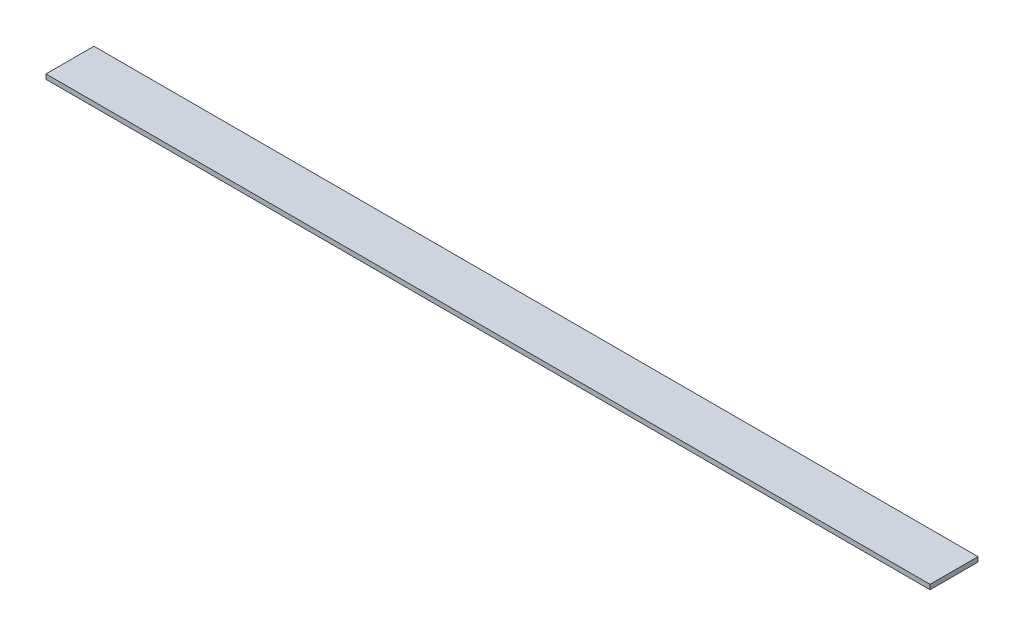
ISO-10303-21;
HEADER;
FILE_DESCRIPTION(('STEP AP214'),'2;1');
FILE_NAME('part.step','',(''),(''),'','','');
FILE_SCHEMA(('AUTOMOTIVE_DESIGN { 1 0 10303 214 1 1 1 1 }'));
ENDSEC;
DATA;
#1=APPLICATION_CONTEXT('core data for automotive mechanical design processes');
#2=APPLICATION_PROTOCOL_DEFINITION('international standard','automotive_design',2000,#1);
#3=PRODUCT_CONTEXT('',#1,'mechanical');
#4=PRODUCT('Part','Part','',(#3));
#5=PRODUCT_RELATED_PRODUCT_CATEGORY('part','',(#4));
#6=PRODUCT_DEFINITION_FORMATION('','',#4);
#7=PRODUCT_DEFINITION_CONTEXT('part definition',#1,'design');
#8=PRODUCT_DEFINITION('design','',#6,#7);
#9=PRODUCT_DEFINITION_SHAPE('','',#8);
#10=(LENGTH_UNIT() NAMED_UNIT(*) SI_UNIT(.MILLI.,.METRE.));
#11=(NAMED_UNIT(*) PLANE_ANGLE_UNIT() SI_UNIT($,.RADIAN.));
#12=(NAMED_UNIT(*) SI_UNIT($,.STERADIAN.) SOLID_ANGLE_UNIT());
#13=UNCERTAINTY_MEASURE_WITH_UNIT(LENGTH_MEASURE(1.E-05),#10,'distance_accuracy_value','');
#14=(GEOMETRIC_REPRESENTATION_CONTEXT(3) GLOBAL_UNCERTAINTY_ASSIGNED_CONTEXT((#13)) GLOBAL_UNIT_ASSIGNED_CONTEXT((#10,
#11,#12)) REPRESENTATION_CONTEXT('',''));
#15=CARTESIAN_POINT('',(0.,0.,0.));
#16=DIRECTION('',(0.,0.,1.));
#17=DIRECTION('',(1.,0.,0.));
#18=AXIS2_PLACEMENT_3D('',#15,#16,#17);
#19=CARTESIAN_POINT('',(-936.625,0.,50.8));
#20=DIRECTION('',(0.,0.,1.));
#21=DIRECTION('',(1.,0.,0.));
#22=AXIS2_PLACEMENT_3D('',#19,#20,#21);
#23=PLANE('',#22);
#24=DIRECTION('',(1.,0.,0.));
#25=VECTOR('',#24,1.);
#26=CARTESIAN_POINT('',(-936.625,10.,50.8));
#27=LINE('',#26,#25);
#28=CARTESIAN_POINT('',(-936.625,10.,50.8));
#29=VERTEX_POINT('',#28);
#30=CARTESIAN_POINT('',(936.625,10.,50.8));
#31=VERTEX_POINT('',#30);
#32=EDGE_CURVE('E95',#29,#31,#27,.T.);
#33=ORIENTED_EDGE('',*,*,#32,.F.);
#34=DIRECTION('',(0.,1.,0.));
#35=VECTOR('',#34,1.);
#36=CARTESIAN_POINT('',(-936.625,0.,50.8));
#37=LINE('',#36,#35);
#38=CARTESIAN_POINT('',(-936.625,0.,50.8));
#39=VERTEX_POINT('',#38);
#40=EDGE_CURVE('E11',#39,#29,#37,.T.);
#41=ORIENTED_EDGE('',*,*,#40,.F.);
#42=DIRECTION('',(1.,0.,0.));
#43=VECTOR('',#42,1.);
#44=CARTESIAN_POINT('',(-936.625,0.,50.8));
#45=LINE('',#44,#43);
#46=CARTESIAN_POINT('',(936.625,0.,50.8));
#47=VERTEX_POINT('',#46);
#48=EDGE_CURVE('E89',#39,#47,#45,.T.);
#49=ORIENTED_EDGE('',*,*,#48,.T.);
#50=DIRECTION('',(0.,1.,0.));
#51=VECTOR('',#50,1.);
#52=CARTESIAN_POINT('',(936.625,0.,50.8));
#53=LINE('',#52,#51);
#54=EDGE_CURVE('E34',#47,#31,#53,.T.);
#55=ORIENTED_EDGE('',*,*,#54,.T.);
#56=EDGE_LOOP('',(#33,#41,#49,#55));
#57=FACE_BOUND('',#56,.T.);
#58=ADVANCED_FACE('F31',(#57),#23,.T.);
#59=CARTESIAN_POINT('',(-936.625,0.,-50.8));
#60=DIRECTION('',(-1.,0.,0.));
#61=DIRECTION('',(0.,0.,1.));
#62=AXIS2_PLACEMENT_3D('',#59,#60,#61);
#63=PLANE('',#62);
#64=DIRECTION('',(0.,0.,1.));
#65=VECTOR('',#64,1.);
#66=CARTESIAN_POINT('',(-936.625,10.,-50.8));
#67=LINE('',#66,#65);
#68=CARTESIAN_POINT('',(-936.625,10.,-50.8));
#69=VERTEX_POINT('',#68);
#70=EDGE_CURVE('E91',#69,#29,#67,.T.);
#71=ORIENTED_EDGE('',*,*,#70,.F.);
#72=DIRECTION('',(0.,1.,0.));
#73=VECTOR('',#72,1.);
#74=CARTESIAN_POINT('',(-936.625,0.,-50.8));
#75=LINE('',#74,#73);
#76=CARTESIAN_POINT('',(-936.625,0.,-50.8));
#77=VERTEX_POINT('',#76);
#78=EDGE_CURVE('E40',#77,#69,#75,.T.);
#79=ORIENTED_EDGE('',*,*,#78,.F.);
#80=DIRECTION('',(0.,0.,1.));
#81=VECTOR('',#80,1.);
#82=CARTESIAN_POINT('',(-936.625,0.,-50.8));
#83=LINE('',#82,#81);
#84=EDGE_CURVE('E86',#77,#39,#83,.T.);
#85=ORIENTED_EDGE('',*,*,#84,.T.);
#86=ORIENTED_EDGE('',*,*,#40,.T.);
#87=EDGE_LOOP('',(#71,#79,#85,#86));
#88=FACE_BOUND('',#87,.T.);
#89=ADVANCED_FACE('F105',(#88),#63,.T.);
#90=CARTESIAN_POINT('',(936.625,0.,-50.8));
#91=DIRECTION('',(0.,0.,-1.));
#92=DIRECTION('',(-1.,0.,0.));
#93=AXIS2_PLACEMENT_3D('',#90,#91,#92);
#94=PLANE('',#93);
#95=DIRECTION('',(-1.,0.,0.));
#96=VECTOR('',#95,1.);
#97=CARTESIAN_POINT('',(936.625,10.,-50.8));
#98=LINE('',#97,#96);
#99=CARTESIAN_POINT('',(936.625,10.,-50.8));
#100=VERTEX_POINT('',#99);
#101=EDGE_CURVE('E81',#100,#69,#98,.T.);
#102=ORIENTED_EDGE('',*,*,#101,.F.);
#103=DIRECTION('',(0.,1.,0.));
#104=VECTOR('',#103,1.);
#105=CARTESIAN_POINT('',(936.625,0.,-50.8));
#106=LINE('',#105,#104);
#107=CARTESIAN_POINT('',(936.625,0.,-50.8));
#108=VERTEX_POINT('',#107);
#109=EDGE_CURVE('E76',#108,#100,#106,.T.);
#110=ORIENTED_EDGE('',*,*,#109,.F.);
#111=DIRECTION('',(-1.,0.,0.));
#112=VECTOR('',#111,1.);
#113=CARTESIAN_POINT('',(936.625,0.,-50.8));
#114=LINE('',#113,#112);
#115=EDGE_CURVE('E79',#108,#77,#114,.T.);
#116=ORIENTED_EDGE('',*,*,#115,.T.);
#117=ORIENTED_EDGE('',*,*,#78,.T.);
#118=EDGE_LOOP('',(#102,#110,#116,#117));
#119=FACE_BOUND('',#118,.T.);
#120=ADVANCED_FACE('F78',(#119),#94,.T.);
#121=CARTESIAN_POINT('',(936.625,0.,50.8));
#122=DIRECTION('',(1.,0.,0.));
#123=DIRECTION('',(0.,0.,-1.));
#124=AXIS2_PLACEMENT_3D('',#121,#122,#123);
#125=PLANE('',#124);
#126=DIRECTION('',(0.,0.,-1.));
#127=VECTOR('',#126,1.);
#128=CARTESIAN_POINT('',(936.625,10.,50.8));
#129=LINE('',#128,#127);
#130=EDGE_CURVE('E98',#31,#100,#129,.T.);
#131=ORIENTED_EDGE('',*,*,#130,.F.);
#132=ORIENTED_EDGE('',*,*,#54,.F.);
#133=DIRECTION('',(0.,0.,-1.));
#134=VECTOR('',#133,1.);
#135=CARTESIAN_POINT('',(936.625,0.,50.8));
#136=LINE('',#135,#134);
#137=EDGE_CURVE('E85',#47,#108,#136,.T.);
#138=ORIENTED_EDGE('',*,*,#137,.T.);
#139=ORIENTED_EDGE('',*,*,#109,.T.);
#140=EDGE_LOOP('',(#131,#132,#138,#139));
#141=FACE_BOUND('',#140,.T.);
#142=ADVANCED_FACE('F88',(#141),#125,.T.);
#143=CARTESIAN_POINT('',(936.625,0.,50.8));
#144=DIRECTION('',(0.,1.,0.));
#145=DIRECTION('',(0.,0.,1.));
#146=AXIS2_PLACEMENT_3D('',#143,#144,#145);
#147=PLANE('',#146);
#148=ORIENTED_EDGE('',*,*,#48,.F.);
#149=ORIENTED_EDGE('',*,*,#84,.F.);
#150=ORIENTED_EDGE('',*,*,#115,.F.);
#151=ORIENTED_EDGE('',*,*,#137,.F.);
#152=EDGE_LOOP('',(#148,#149,#150,#151));
#153=FACE_BOUND('',#152,.T.);
#154=ADVANCED_FACE('F84',(#153),#147,.F.);
#155=CARTESIAN_POINT('',(936.625,10.,50.8));
#156=DIRECTION('',(0.,1.,0.));
#157=DIRECTION('',(0.,0.,1.));
#158=AXIS2_PLACEMENT_3D('',#155,#156,#157);
#159=PLANE('',#158);
#160=ORIENTED_EDGE('',*,*,#32,.T.);
#161=ORIENTED_EDGE('',*,*,#130,.T.);
#162=ORIENTED_EDGE('',*,*,#101,.T.);
#163=ORIENTED_EDGE('',*,*,#70,.T.);
#164=EDGE_LOOP('',(#160,#161,#162,#163));
#165=FACE_BOUND('',#164,.T.);
#166=ADVANCED_FACE('F104',(#165),#159,.T.);
#167=CLOSED_SHELL('',(#58,#89,#120,#142,#154,#166));
#168=MANIFOLD_SOLID_BREP('B2',#167);
#169=ADVANCED_BREP_SHAPE_REPRESENTATION('',(#18,#168),#14);
#170=SHAPE_DEFINITION_REPRESENTATION(#9,#169);
ENDSEC;
END-ISO-10303-21;
